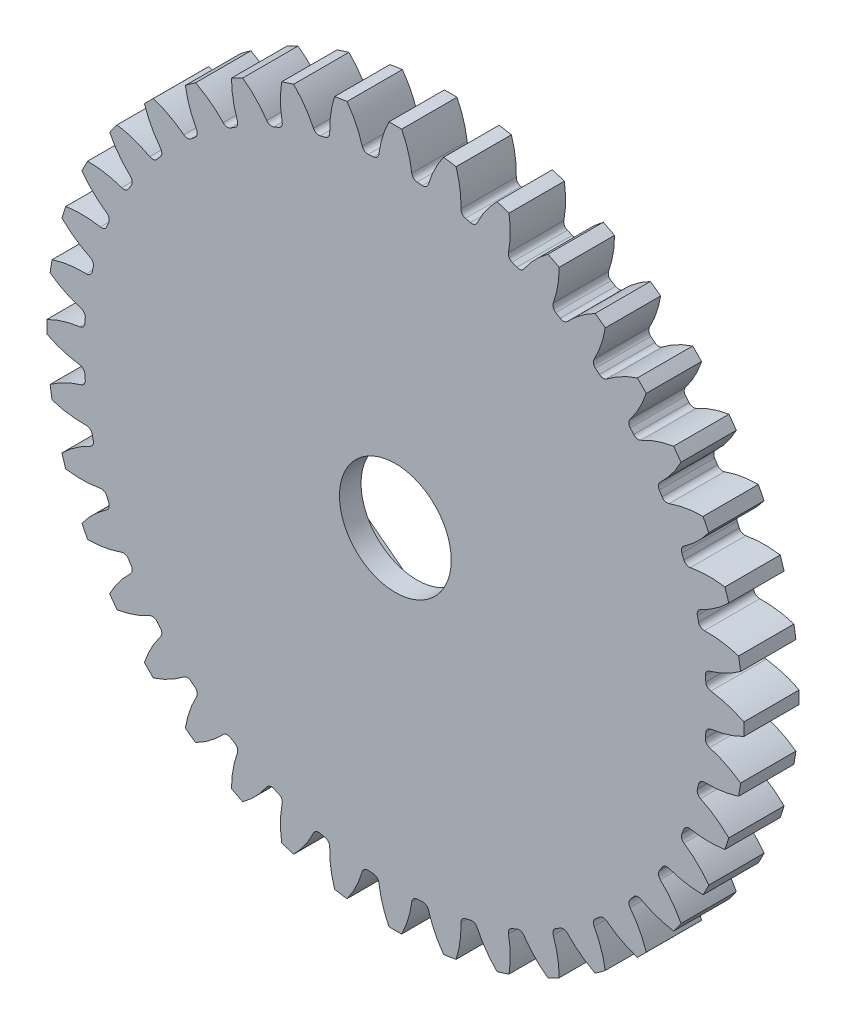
from build123d import *

# Parameters (mm, degrees)
BOSS_EXTRU_1_DEPTH                 = 10
CONG_1_R                           = 1.05
R_P_TITION_CIRCULAIRE4_COUNT       = 40
CONG_1_OF_R_P_TITION_CIRCULAIRE4_R = 1.05
ESQUISSE6_R                        = 10.1
ENL_V_MAT_EXTRU_2_DEPTH            = 10
ENL_V_MAT_EXTRU_3_DEPTH            = 6.1


with BuildPart() as part:
    # Esquisse3 → Boss.-Extru.1 (new body)
    with BuildSketch(Plane.XY):
        with BuildLine():
            Line((-5.792031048, 55.516247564), (-1.378706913, -0.560352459))
            Line((-1.378706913, -0.560352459), (3.034617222, 55.516247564))
            ThreePointArc((3.034617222, 55.516247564), (2.360175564, 55.565250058), (1.68519356, 55.606141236))
            ThreePointArc((1.68519356, 55.606141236), (1.058599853, 59.112109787), (-0.237772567, 62.429315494))
            ThreePointArc((-0.237772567, 62.429315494), (-1.378706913, 62.439647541), (-2.51964126, 62.429315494))
            ThreePointArc((-2.51964126, 62.429315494), (-3.816013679, 59.112109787), (-4.442607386, 55.606141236))
            ThreePointArc((-4.442607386, 55.606141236), (-5.11758939, 55.565250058), (-5.792031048, 55.516247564))
        make_face()
    boss_extru_1 = extrude(amount=BOSS_EXTRU_1_DEPTH)

    # Cong_1
    cong_1_edges = [part.edges().sort_by_distance(p)[0] for p in [
        (-4.442607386, 55.606141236, 5),
        (1.68519356, 55.606141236, 5),
    ]]
    fillet(cong_1_edges, radius=CONG_1_R)

    # R_p_tition circulaire4: Boss.-Extru.1 ×40 about axis
    r_p_tition_circulaire4_axis = Axis((-1.378706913, -0.560352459, 0), (0, 0, 1))
    for i in range(1, R_P_TITION_CIRCULAIRE4_COUNT):
        add(boss_extru_1.rotate(r_p_tition_circulaire4_axis, i * 360 / R_P_TITION_CIRCULAIRE4_COUNT))

    # Cong_1 of R_p_tition circulaire4
    cong_1_of_r_p_tition_circulaire4_edges = [part.edges().sort_by_distance(p)[0] for p in [
        (-13.191261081, 54.435338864, 5),
        (-7.138903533, 55.393938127, 5),
        (-21.649050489, 51.910360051, 5),
        (-15.821165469, 53.803954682, 5),
        (-29.607716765, 48.093378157, 5),
        (-24.147806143, 50.875341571, 5),
        (-36.871291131, 43.078379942, 5),
        (-31.913796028, 46.680210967, 5),
        (-43.260920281, 36.988851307, 5),
        (-38.927910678, 41.321860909, 5),
        (-48.619270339, 29.974736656, 5),
        (-45.017439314, 34.93223176, 5),
        (-52.814400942, 22.208746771, 5),
        (-50.032437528, 27.668657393, 5),
        (-55.743014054, 13.882106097, 5),
        (-53.849419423, 19.709991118, 5),
        (-57.332997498, 5.199844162, 5),
        (-56.374398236, 11.25220171, 5),
        (-57.545200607, -3.624252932, 5),
        (-57.545200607, 2.503548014, 5),
        (-56.374398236, -12.372906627, 5),
        (-57.332997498, -6.320549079, 5),
        (-53.849419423, -20.830696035, 5),
        (-55.743014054, -15.002811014, 5),
        (-50.032437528, -28.78936231, 5),
        (-52.814400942, -23.329451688, 5),
        (-45.017439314, -36.052936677, 5),
        (-48.619270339, -31.095441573, 5),
        (-38.927910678, -42.442565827, 5),
        (-43.260920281, -38.109556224, 5),
        (-31.913796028, -47.800915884, 5),
        (-36.871291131, -44.199084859, 5),
        (-24.147806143, -51.996046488, 5),
        (-29.607716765, -49.214083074, 5),
        (-15.821165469, -54.924659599, 5),
        (-21.649050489, -53.031064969, 5),
        (-7.138903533, -56.514643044, 5),
        (-13.191261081, -55.556043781, 5),
        (1.68519356, -56.726846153, 5),
        (-4.442607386, -56.726846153, 5),
        (10.433847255, -55.556043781, 5),
        (4.381489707, -56.514643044, 5),
        (18.891636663, -53.031064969, 5),
        (13.063751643, -54.924659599, 5),
        (26.850302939, -49.214083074, 5),
        (21.390392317, -51.996046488, 5),
        (34.113877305, -44.199084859, 5),
        (29.156382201, -47.800915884, 5),
        (40.503506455, -38.109556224, 5),
        (36.170496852, -42.442565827, 5),
        (45.861856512, -31.095441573, 5),
        (42.260025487, -36.052936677, 5),
        (50.056987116, -23.329451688, 5),
        (47.275023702, -28.78936231, 5),
        (52.985600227, -15.002811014, 5),
        (51.092005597, -20.830696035, 5),
        (54.575583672, -6.320549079, 5),
        (53.616984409, -12.372906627, 5),
        (54.787786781, 2.503548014, 5),
        (54.787786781, -3.624252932, 5),
        (53.616984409, 11.25220171, 5),
        (54.575583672, 5.199844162, 5),
        (51.092005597, 19.709991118, 5),
        (52.985600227, 13.882106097, 5),
        (47.275023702, 27.668657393, 5),
        (50.056987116, 22.208746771, 5),
        (42.260025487, 34.93223176, 5),
        (45.861856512, 29.974736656, 5),
        (36.170496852, 41.321860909, 5),
        (40.503506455, 36.988851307, 5),
        (29.156382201, 46.680210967, 5),
        (34.113877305, 43.078379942, 5),
        (21.390392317, 50.875341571, 5),
        (26.850302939, 48.093378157, 5),
        (13.063751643, 53.803954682, 5),
        (18.891636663, 51.910360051, 5),
        (4.381489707, 55.393938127, 5),
        (10.433847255, 54.435338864, 5),
    ]]
    fillet(cong_1_of_r_p_tition_circulaire4_edges, radius=CONG_1_OF_R_P_TITION_CIRCULAIRE4_R)

    # Esquisse6 → Enl_v. mat.-Extru.2 (cut)
    with BuildSketch(Plane.XY.offset(10)):
        with Locations((-1.378706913, -0.560352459)):
            Circle(ESQUISSE6_R)
    extrude(amount=-ENL_V_MAT_EXTRU_2_DEPTH, mode=Mode.SUBTRACT)

    # Esquisse7 → Enl_v. mat.-Extru.3 (cut)
    with BuildSketch(Plane(origin=(0, 0, 0), x_dir=(-1, 0, 0), z_dir=(0, 0, -1))):
        Polygon((-8.254583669, -17.245701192), (6.365265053, -19.17044079), (18.064055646, -10.193643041), (19.988795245, 4.426205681), (11.011997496, 16.124996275), (-3.607851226, 18.049735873), (-15.30664182, 9.072938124), (-17.231381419, -5.546910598), align=None)
    extrude(amount=-ENL_V_MAT_EXTRU_3_DEPTH, mode=Mode.SUBTRACT)


solid = part.part
